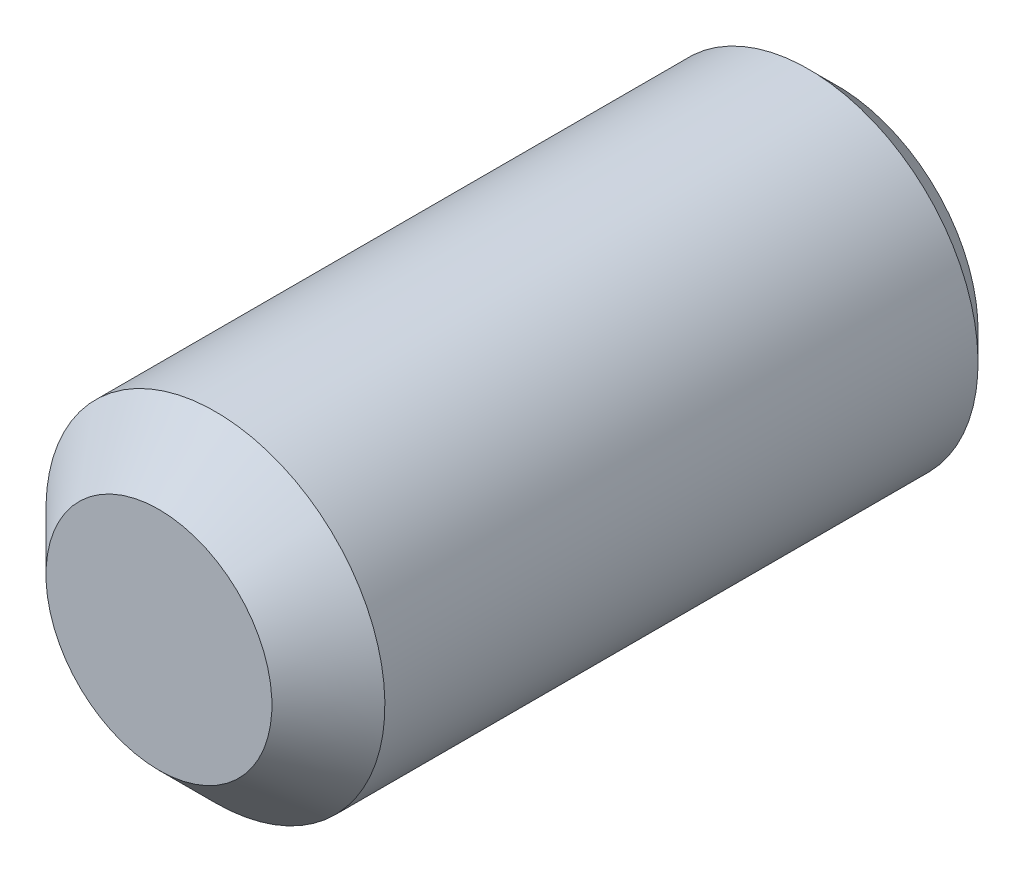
ISO-10303-21;
HEADER;
FILE_DESCRIPTION(('STEP AP214'),'2;1');
FILE_NAME('part.step','',(''),(''),'','','');
FILE_SCHEMA(('AUTOMOTIVE_DESIGN { 1 0 10303 214 1 1 1 1 }'));
ENDSEC;
DATA;
#1=APPLICATION_CONTEXT('core data for automotive mechanical design processes');
#2=APPLICATION_PROTOCOL_DEFINITION('international standard','automotive_design',2000,#1);
#3=PRODUCT_CONTEXT('',#1,'mechanical');
#4=PRODUCT('Part','Part','',(#3));
#5=PRODUCT_RELATED_PRODUCT_CATEGORY('part','',(#4));
#6=PRODUCT_DEFINITION_FORMATION('','',#4);
#7=PRODUCT_DEFINITION_CONTEXT('part definition',#1,'design');
#8=PRODUCT_DEFINITION('design','',#6,#7);
#9=PRODUCT_DEFINITION_SHAPE('','',#8);
#10=(LENGTH_UNIT() NAMED_UNIT(*) SI_UNIT(.MILLI.,.METRE.));
#11=(NAMED_UNIT(*) PLANE_ANGLE_UNIT() SI_UNIT($,.RADIAN.));
#12=(NAMED_UNIT(*) SI_UNIT($,.STERADIAN.) SOLID_ANGLE_UNIT());
#13=UNCERTAINTY_MEASURE_WITH_UNIT(LENGTH_MEASURE(1.E-05),#10,'distance_accuracy_value','');
#14=(GEOMETRIC_REPRESENTATION_CONTEXT(3) GLOBAL_UNCERTAINTY_ASSIGNED_CONTEXT((#13)) GLOBAL_UNIT_ASSIGNED_CONTEXT((#10,
#11,#12)) REPRESENTATION_CONTEXT('',''));
#15=CARTESIAN_POINT('',(0.,0.,0.));
#16=DIRECTION('',(0.,0.,1.));
#17=DIRECTION('',(1.,0.,0.));
#18=AXIS2_PLACEMENT_3D('',#15,#16,#17);
#19=CARTESIAN_POINT('',(0.,2.,12.));
#20=DIRECTION('',(0.,0.,-1.));
#21=DIRECTION('',(0.,1.,0.));
#22=AXIS2_PLACEMENT_3D('',#19,#20,#21);
#23=PLANE('',#22);
#24=CARTESIAN_POINT('',(0.,0.,12.));
#25=DIRECTION('',(0.,0.,1.));
#26=DIRECTION('',(0.,-1.,0.));
#27=AXIS2_PLACEMENT_3D('',#24,#25,#26);
#28=CIRCLE('',#27,2.);
#29=CARTESIAN_POINT('',(0.,-2.,12.));
#30=VERTEX_POINT('',#29);
#31=EDGE_CURVE('E149',#30,#30,#28,.T.);
#32=ORIENTED_EDGE('',*,*,#31,.T.);
#33=EDGE_LOOP('',(#32));
#34=FACE_BOUND('',#33,.T.);
#35=ADVANCED_FACE('F36',(#34),#23,.F.);
#36=CARTESIAN_POINT('',(0.,1.5,0.));
#37=DIRECTION('',(0.,0.,1.));
#38=DIRECTION('',(0.,-1.,0.));
#39=AXIS2_PLACEMENT_3D('',#36,#37,#38);
#40=PLANE('',#39);
#41=CARTESIAN_POINT('',(0.,0.,0.));
#42=DIRECTION('',(0.,0.,1.));
#43=DIRECTION('',(0.,-1.,0.));
#44=AXIS2_PLACEMENT_3D('',#41,#42,#43);
#45=CIRCLE('',#44,2.49);
#46=CARTESIAN_POINT('',(0.,-2.49,0.));
#47=VERTEX_POINT('',#46);
#48=EDGE_CURVE('E178',#47,#47,#45,.T.);
#49=ORIENTED_EDGE('',*,*,#48,.F.);
#50=EDGE_LOOP('',(#49));
#51=FACE_BOUND('',#50,.T.);
#52=DIRECTION('',(0.499999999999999,-0.866025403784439,0.));
#53=VECTOR('',#52,1.);
#54=CARTESIAN_POINT('',(-1.94855715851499,0.375000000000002,0.));
#55=LINE('',#54,#53);
#56=CARTESIAN_POINT('',(-1.73205080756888,0.,0.));
#57=VERTEX_POINT('',#56);
#58=CARTESIAN_POINT('',(-0.86602540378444,-1.5,0.));
#59=VERTEX_POINT('',#58);
#60=EDGE_CURVE('E57',#57,#59,#55,.T.);
#61=ORIENTED_EDGE('',*,*,#60,.T.);
#62=DIRECTION('',(1.,0.,0.));
#63=VECTOR('',#62,1.);
#64=CARTESIAN_POINT('',(0.,-1.5,0.));
#65=LINE('',#64,#63);
#66=CARTESIAN_POINT('',(0.866025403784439,-1.5,0.));
#67=VERTEX_POINT('',#66);
#68=EDGE_CURVE('E11',#59,#67,#65,.T.);
#69=ORIENTED_EDGE('',*,*,#68,.T.);
#70=DIRECTION('',(0.499999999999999,0.866025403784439,0.));
#71=VECTOR('',#70,1.);
#72=CARTESIAN_POINT('',(1.94855715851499,0.375000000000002,0.));
#73=LINE('',#72,#71);
#74=CARTESIAN_POINT('',(1.73205080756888,0.,0.));
#75=VERTEX_POINT('',#74);
#76=EDGE_CURVE('E43',#67,#75,#73,.T.);
#77=ORIENTED_EDGE('',*,*,#76,.T.);
#78=DIRECTION('',(-0.5,0.866025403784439,0.));
#79=VECTOR('',#78,1.);
#80=CARTESIAN_POINT('',(0.649519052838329,1.875,0.));
#81=LINE('',#80,#79);
#82=CARTESIAN_POINT('',(0.866025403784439,1.5,0.));
#83=VERTEX_POINT('',#82);
#84=EDGE_CURVE('E189',#75,#83,#81,.T.);
#85=ORIENTED_EDGE('',*,*,#84,.T.);
#86=DIRECTION('',(-1.,0.,0.));
#87=VECTOR('',#86,1.);
#88=CARTESIAN_POINT('',(0.,1.5,0.));
#89=LINE('',#88,#87);
#90=CARTESIAN_POINT('',(-0.866025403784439,1.5,0.));
#91=VERTEX_POINT('',#90);
#92=EDGE_CURVE('E187',#83,#91,#89,.T.);
#93=ORIENTED_EDGE('',*,*,#92,.T.);
#94=DIRECTION('',(-0.5,-0.866025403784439,0.));
#95=VECTOR('',#94,1.);
#96=CARTESIAN_POINT('',(-0.649519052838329,1.875,0.));
#97=LINE('',#96,#95);
#98=EDGE_CURVE('E185',#91,#57,#97,.T.);
#99=ORIENTED_EDGE('',*,*,#98,.T.);
#100=EDGE_LOOP('',(#61,#69,#77,#85,#93,#99));
#101=FACE_BOUND('',#100,.T.);
#102=ADVANCED_FACE('F192',(#51,#101),#40,.F.);
#103=CARTESIAN_POINT('',(0.,0.,4.40129092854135));
#104=DIRECTION('',(0.,0.,1.));
#105=DIRECTION('',(0.,-1.,0.));
#106=AXIS2_PLACEMENT_3D('',#103,#104,#105);
#107=CYLINDRICAL_SURFACE('',#106,2.49);
#108=CARTESIAN_POINT('',(0.,0.,11.4958578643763));
#109=DIRECTION('',(0.,0.,1.));
#110=DIRECTION('',(0.,-1.,0.));
#111=AXIS2_PLACEMENT_3D('',#108,#109,#110);
#112=CIRCLE('',#111,2.49);
#113=CARTESIAN_POINT('',(0.,-2.49,11.4958578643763));
#114=VERTEX_POINT('',#113);
#115=EDGE_CURVE('E175',#114,#114,#112,.T.);
#116=ORIENTED_EDGE('',*,*,#115,.F.);
#117=EDGE_LOOP('',(#116));
#118=FACE_BOUND('',#117,.T.);
#119=ORIENTED_EDGE('',*,*,#48,.T.);
#120=EDGE_LOOP('',(#119));
#121=FACE_BOUND('',#120,.T.);
#122=ADVANCED_FACE('F248',(#118,#121),#107,.T.);
#123=CARTESIAN_POINT('',(0.,0.,11.4958578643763));
#124=DIRECTION('',(0.,0.,-1.));
#125=DIRECTION('',(0.,1.,0.));
#126=AXIS2_PLACEMENT_3D('',#123,#124,#125);
#127=CONICAL_SURFACE('',#126,2.49,0.785398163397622);
#128=CARTESIAN_POINT('',(0.,0.,11.4858578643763));
#129=DIRECTION('',(0.,0.,1.));
#130=DIRECTION('',(0.,-1.,0.));
#131=AXIS2_PLACEMENT_3D('',#128,#129,#130);
#132=CIRCLE('',#131,2.5);
#133=CARTESIAN_POINT('',(0.,-2.5,11.4858578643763));
#134=VERTEX_POINT('',#133);
#135=EDGE_CURVE('E172',#134,#134,#132,.T.);
#136=ORIENTED_EDGE('',*,*,#135,.F.);
#137=EDGE_LOOP('',(#136));
#138=FACE_BOUND('',#137,.T.);
#139=ORIENTED_EDGE('',*,*,#115,.T.);
#140=EDGE_LOOP('',(#139));
#141=FACE_BOUND('',#140,.T.);
#142=ADVANCED_FACE('F273',(#138,#141),#127,.F.);
#143=CARTESIAN_POINT('',(0.,0.,4.40129092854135));
#144=DIRECTION('',(0.,0.,1.));
#145=DIRECTION('',(0.,-1.,0.));
#146=AXIS2_PLACEMENT_3D('',#143,#144,#145);
#147=CYLINDRICAL_SURFACE('',#146,2.5);
#148=CARTESIAN_POINT('',(0.,0.,0.));
#149=DIRECTION('',(0.,0.,1.));
#150=DIRECTION('',(0.,-1.,0.));
#151=AXIS2_PLACEMENT_3D('',#148,#149,#150);
#152=CIRCLE('',#151,2.5);
#153=CARTESIAN_POINT('',(0.,-2.5,0.));
#154=VERTEX_POINT('',#153);
#155=EDGE_CURVE('E169',#154,#154,#152,.T.);
#156=ORIENTED_EDGE('',*,*,#155,.F.);
#157=EDGE_LOOP('',(#156));
#158=FACE_BOUND('',#157,.T.);
#159=ORIENTED_EDGE('',*,*,#135,.T.);
#160=EDGE_LOOP('',(#159));
#161=FACE_BOUND('',#160,.T.);
#162=ADVANCED_FACE('F267',(#158,#161),#147,.F.);
#163=CARTESIAN_POINT('',(0.,0.,0.));
#164=DIRECTION('',(0.,0.,1.));
#165=DIRECTION('',(0.,-1.,0.));
#166=AXIS2_PLACEMENT_3D('',#163,#164,#165);
#167=CONICAL_SURFACE('',#166,2.5,0.785398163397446);
#168=CARTESIAN_POINT('',(0.,0.,0.5));
#169=DIRECTION('',(0.,0.,1.));
#170=DIRECTION('',(0.,-1.,0.));
#171=AXIS2_PLACEMENT_3D('',#168,#169,#170);
#172=CIRCLE('',#171,3.);
#173=CARTESIAN_POINT('',(0.,-3.,0.5));
#174=VERTEX_POINT('',#173);
#175=EDGE_CURVE('E166',#174,#174,#172,.T.);
#176=ORIENTED_EDGE('',*,*,#175,.F.);
#177=EDGE_LOOP('',(#176));
#178=FACE_BOUND('',#177,.T.);
#179=ORIENTED_EDGE('',*,*,#155,.T.);
#180=EDGE_LOOP('',(#179));
#181=FACE_BOUND('',#180,.T.);
#182=ADVANCED_FACE('F261',(#178,#181),#167,.T.);
#183=CARTESIAN_POINT('',(0.,0.,4.40129092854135));
#184=DIRECTION('',(0.,0.,1.));
#185=DIRECTION('',(0.,-1.,0.));
#186=AXIS2_PLACEMENT_3D('',#183,#184,#185);
#187=CYLINDRICAL_SURFACE('',#186,3.);
#188=CARTESIAN_POINT('',(0.,0.,11.));
#189=DIRECTION('',(0.,0.,1.));
#190=DIRECTION('',(0.,-1.,0.));
#191=AXIS2_PLACEMENT_3D('',#188,#189,#190);
#192=CIRCLE('',#191,3.);
#193=CARTESIAN_POINT('',(0.,-3.,11.));
#194=VERTEX_POINT('',#193);
#195=EDGE_CURVE('E163',#194,#194,#192,.T.);
#196=ORIENTED_EDGE('',*,*,#195,.F.);
#197=EDGE_LOOP('',(#196));
#198=FACE_BOUND('',#197,.T.);
#199=ORIENTED_EDGE('',*,*,#175,.T.);
#200=EDGE_LOOP('',(#199));
#201=FACE_BOUND('',#200,.T.);
#202=ADVANCED_FACE('F255',(#198,#201),#187,.T.);
#203=CARTESIAN_POINT('',(0.,0.,11.));
#204=DIRECTION('',(0.,0.,-1.));
#205=DIRECTION('',(0.,1.,0.));
#206=AXIS2_PLACEMENT_3D('',#203,#204,#205);
#207=CONICAL_SURFACE('',#206,3.,0.785398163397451);
#208=ORIENTED_EDGE('',*,*,#31,.F.);
#209=EDGE_LOOP('',(#208));
#210=FACE_BOUND('',#209,.T.);
#211=ORIENTED_EDGE('',*,*,#195,.T.);
#212=EDGE_LOOP('',(#211));
#213=FACE_BOUND('',#212,.T.);
#214=ADVANCED_FACE('F242',(#210,#213),#207,.T.);
#215=CARTESIAN_POINT('',(0.,0.,3.5));
#216=DIRECTION('',(0.,0.,-1.));
#217=DIRECTION('',(0.,1.,0.));
#218=AXIS2_PLACEMENT_3D('',#215,#216,#217);
#219=PLANE('',#218);
#220=CARTESIAN_POINT('',(0.,0.,3.5));
#221=DIRECTION('',(0.,0.,1.));
#222=DIRECTION('',(0.,-1.,0.));
#223=AXIS2_PLACEMENT_3D('',#220,#221,#222);
#224=CIRCLE('',#223,1.5);
#225=CARTESIAN_POINT('',(0.,1.5,3.5));
#226=VERTEX_POINT('',#225);
#227=CARTESIAN_POINT('',(-1.29903810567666,0.75,3.5));
#228=VERTEX_POINT('',#227);
#229=EDGE_CURVE('E214',#226,#228,#224,.T.);
#230=ORIENTED_EDGE('',*,*,#229,.T.);
#231=DIRECTION('',(0.5,0.866025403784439,0.));
#232=VECTOR('',#231,1.);
#233=CARTESIAN_POINT('',(-1.73205080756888,0.,3.5));
#234=LINE('',#233,#232);
#235=CARTESIAN_POINT('',(-0.866025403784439,1.5,3.5));
#236=VERTEX_POINT('',#235);
#237=EDGE_CURVE('E132',#228,#236,#234,.T.);
#238=ORIENTED_EDGE('',*,*,#237,.T.);
#239=DIRECTION('',(1.,0.,0.));
#240=VECTOR('',#239,1.);
#241=CARTESIAN_POINT('',(-0.866025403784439,1.5,3.5));
#242=LINE('',#241,#240);
#243=EDGE_CURVE('E139',#236,#226,#242,.T.);
#244=ORIENTED_EDGE('',*,*,#243,.T.);
#245=EDGE_LOOP('',(#230,#238,#244));
#246=FACE_BOUND('',#245,.T.);
#247=ADVANCED_FACE('F228',(#246),#219,.T.);
#248=CARTESIAN_POINT('',(-1.29903810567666,-0.749999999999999,3.5));
#249=VERTEX_POINT('',#248);
#250=EDGE_CURVE('E216',#228,#249,#224,.T.);
#251=ORIENTED_EDGE('',*,*,#250,.T.);
#252=DIRECTION('',(-0.499999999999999,0.866025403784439,0.));
#253=VECTOR('',#252,1.);
#254=CARTESIAN_POINT('',(-0.866025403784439,-1.5,3.5));
#255=LINE('',#254,#253);
#256=CARTESIAN_POINT('',(-1.73205080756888,0.,3.5));
#257=VERTEX_POINT('',#256);
#258=EDGE_CURVE('E131',#249,#257,#255,.T.);
#259=ORIENTED_EDGE('',*,*,#258,.T.);
#260=EDGE_CURVE('E134',#257,#228,#234,.T.);
#261=ORIENTED_EDGE('',*,*,#260,.T.);
#262=EDGE_LOOP('',(#251,#259,#261));
#263=FACE_BOUND('',#262,.T.);
#264=ADVANCED_FACE('F221',(#263),#219,.T.);
#265=CARTESIAN_POINT('',(0.,-1.5,3.5));
#266=VERTEX_POINT('',#265);
#267=EDGE_CURVE('E114',#249,#266,#224,.T.);
#268=ORIENTED_EDGE('',*,*,#267,.T.);
#269=DIRECTION('',(-1.,0.,0.));
#270=VECTOR('',#269,1.);
#271=CARTESIAN_POINT('',(0.866025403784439,-1.5,3.5));
#272=LINE('',#271,#270);
#273=CARTESIAN_POINT('',(-0.866025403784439,-1.5,3.5));
#274=VERTEX_POINT('',#273);
#275=EDGE_CURVE('E108',#266,#274,#272,.T.);
#276=ORIENTED_EDGE('',*,*,#275,.T.);
#277=EDGE_CURVE('E112',#274,#249,#255,.T.);
#278=ORIENTED_EDGE('',*,*,#277,.T.);
#279=EDGE_LOOP('',(#268,#276,#278));
#280=FACE_BOUND('',#279,.T.);
#281=ADVANCED_FACE('F110',(#280),#219,.T.);
#282=CARTESIAN_POINT('',(1.29903810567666,-0.749999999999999,3.5));
#283=VERTEX_POINT('',#282);
#284=EDGE_CURVE('E181',#266,#283,#224,.T.);
#285=ORIENTED_EDGE('',*,*,#284,.T.);
#286=DIRECTION('',(-0.499999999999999,-0.866025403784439,0.));
#287=VECTOR('',#286,1.);
#288=CARTESIAN_POINT('',(1.73205080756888,0.,3.5));
#289=LINE('',#288,#287);
#290=CARTESIAN_POINT('',(0.866025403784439,-1.5,3.5));
#291=VERTEX_POINT('',#290);
#292=EDGE_CURVE('E144',#283,#291,#289,.T.);
#293=ORIENTED_EDGE('',*,*,#292,.T.);
#294=EDGE_CURVE('E118',#291,#266,#272,.T.);
#295=ORIENTED_EDGE('',*,*,#294,.T.);
#296=EDGE_LOOP('',(#285,#293,#295));
#297=FACE_BOUND('',#296,.T.);
#298=ADVANCED_FACE('F239',(#297),#219,.T.);
#299=CARTESIAN_POINT('',(1.29903810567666,0.750000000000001,3.5));
#300=VERTEX_POINT('',#299);
#301=EDGE_CURVE('E183',#283,#300,#224,.T.);
#302=ORIENTED_EDGE('',*,*,#301,.T.);
#303=DIRECTION('',(0.5,-0.866025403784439,0.));
#304=VECTOR('',#303,1.);
#305=CARTESIAN_POINT('',(0.866025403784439,1.5,3.5));
#306=LINE('',#305,#304);
#307=CARTESIAN_POINT('',(1.73205080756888,0.,3.5));
#308=VERTEX_POINT('',#307);
#309=EDGE_CURVE('E142',#300,#308,#306,.T.);
#310=ORIENTED_EDGE('',*,*,#309,.T.);
#311=EDGE_CURVE('E126',#308,#283,#289,.T.);
#312=ORIENTED_EDGE('',*,*,#311,.T.);
#313=EDGE_LOOP('',(#302,#310,#312));
#314=FACE_BOUND('',#313,.T.);
#315=ADVANCED_FACE('F206',(#314),#219,.T.);
#316=EDGE_CURVE('E213',#300,#226,#224,.T.);
#317=ORIENTED_EDGE('',*,*,#316,.T.);
#318=CARTESIAN_POINT('',(0.866025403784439,1.5,3.5));
#319=VERTEX_POINT('',#318);
#320=EDGE_CURVE('E138',#226,#319,#242,.T.);
#321=ORIENTED_EDGE('',*,*,#320,.T.);
#322=EDGE_CURVE('E50',#319,#300,#306,.T.);
#323=ORIENTED_EDGE('',*,*,#322,.T.);
#324=EDGE_LOOP('',(#317,#321,#323));
#325=FACE_BOUND('',#324,.T.);
#326=ADVANCED_FACE('F231',(#325),#219,.T.);
#327=CARTESIAN_POINT('',(0.866025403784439,-1.5,3.5));
#328=DIRECTION('',(0.,-1.,0.));
#329=DIRECTION('',(0.,0.,-1.));
#330=AXIS2_PLACEMENT_3D('',#327,#328,#329);
#331=PLANE('',#330);
#332=ORIENTED_EDGE('',*,*,#294,.F.);
#333=DIRECTION('',(0.,0.,-1.));
#334=VECTOR('',#333,1.);
#335=CARTESIAN_POINT('',(0.866025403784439,-1.5,3.5));
#336=LINE('',#335,#334);
#337=EDGE_CURVE('E147',#291,#67,#336,.T.);
#338=ORIENTED_EDGE('',*,*,#337,.T.);
#339=ORIENTED_EDGE('',*,*,#68,.F.);
#340=DIRECTION('',(0.,0.,-1.));
#341=VECTOR('',#340,1.);
#342=CARTESIAN_POINT('',(-0.866025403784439,-1.5,3.5));
#343=LINE('',#342,#341);
#344=EDGE_CURVE('E121',#274,#59,#343,.T.);
#345=ORIENTED_EDGE('',*,*,#344,.F.);
#346=ORIENTED_EDGE('',*,*,#275,.F.);
#347=EDGE_LOOP('',(#332,#338,#339,#345,#346));
#348=FACE_BOUND('',#347,.T.);
#349=ADVANCED_FACE('F122',(#348),#331,.F.);
#350=CARTESIAN_POINT('',(1.73205080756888,0.,3.5));
#351=DIRECTION('',(0.866025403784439,-0.499999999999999,0.));
#352=DIRECTION('',(0.499999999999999,0.866025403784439,0.));
#353=AXIS2_PLACEMENT_3D('',#350,#351,#352);
#354=PLANE('',#353);
#355=ORIENTED_EDGE('',*,*,#311,.F.);
#356=DIRECTION('',(0.,0.,-1.));
#357=VECTOR('',#356,1.);
#358=CARTESIAN_POINT('',(1.73205080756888,0.,3.5));
#359=LINE('',#358,#357);
#360=EDGE_CURVE('E150',#308,#75,#359,.T.);
#361=ORIENTED_EDGE('',*,*,#360,.T.);
#362=ORIENTED_EDGE('',*,*,#76,.F.);
#363=ORIENTED_EDGE('',*,*,#337,.F.);
#364=ORIENTED_EDGE('',*,*,#292,.F.);
#365=EDGE_LOOP('',(#355,#361,#362,#363,#364));
#366=FACE_BOUND('',#365,.T.);
#367=ADVANCED_FACE('F201',(#366),#354,.F.);
#368=CARTESIAN_POINT('',(0.866025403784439,1.5,3.5));
#369=DIRECTION('',(0.866025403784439,0.5,0.));
#370=DIRECTION('',(-0.5,0.866025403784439,0.));
#371=AXIS2_PLACEMENT_3D('',#368,#369,#370);
#372=PLANE('',#371);
#373=ORIENTED_EDGE('',*,*,#322,.F.);
#374=DIRECTION('',(0.,0.,-1.));
#375=VECTOR('',#374,1.);
#376=CARTESIAN_POINT('',(0.866025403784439,1.5,3.5));
#377=LINE('',#376,#375);
#378=EDGE_CURVE('E153',#319,#83,#377,.T.);
#379=ORIENTED_EDGE('',*,*,#378,.T.);
#380=ORIENTED_EDGE('',*,*,#84,.F.);
#381=ORIENTED_EDGE('',*,*,#360,.F.);
#382=ORIENTED_EDGE('',*,*,#309,.F.);
#383=EDGE_LOOP('',(#373,#379,#380,#381,#382));
#384=FACE_BOUND('',#383,.T.);
#385=ADVANCED_FACE('F198',(#384),#372,.F.);
#386=CARTESIAN_POINT('',(-0.866025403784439,1.5,3.5));
#387=DIRECTION('',(0.,1.,0.));
#388=DIRECTION('',(0.,0.,1.));
#389=AXIS2_PLACEMENT_3D('',#386,#387,#388);
#390=PLANE('',#389);
#391=ORIENTED_EDGE('',*,*,#243,.F.);
#392=DIRECTION('',(0.,0.,-1.));
#393=VECTOR('',#392,1.);
#394=CARTESIAN_POINT('',(-0.866025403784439,1.5,3.5));
#395=LINE('',#394,#393);
#396=EDGE_CURVE('E156',#236,#91,#395,.T.);
#397=ORIENTED_EDGE('',*,*,#396,.T.);
#398=ORIENTED_EDGE('',*,*,#92,.F.);
#399=ORIENTED_EDGE('',*,*,#378,.F.);
#400=ORIENTED_EDGE('',*,*,#320,.F.);
#401=EDGE_LOOP('',(#391,#397,#398,#399,#400));
#402=FACE_BOUND('',#401,.T.);
#403=ADVANCED_FACE('F230',(#402),#390,.F.);
#404=CARTESIAN_POINT('',(-1.73205080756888,0.,3.5));
#405=DIRECTION('',(-0.866025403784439,0.5,0.));
#406=DIRECTION('',(-0.5,-0.866025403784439,0.));
#407=AXIS2_PLACEMENT_3D('',#404,#405,#406);
#408=PLANE('',#407);
#409=ORIENTED_EDGE('',*,*,#260,.F.);
#410=DIRECTION('',(0.,0.,-1.));
#411=VECTOR('',#410,1.);
#412=CARTESIAN_POINT('',(-1.73205080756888,0.,3.5));
#413=LINE('',#412,#411);
#414=EDGE_CURVE('E125',#257,#57,#413,.T.);
#415=ORIENTED_EDGE('',*,*,#414,.T.);
#416=ORIENTED_EDGE('',*,*,#98,.F.);
#417=ORIENTED_EDGE('',*,*,#396,.F.);
#418=ORIENTED_EDGE('',*,*,#237,.F.);
#419=EDGE_LOOP('',(#409,#415,#416,#417,#418));
#420=FACE_BOUND('',#419,.T.);
#421=ADVANCED_FACE('F224',(#420),#408,.F.);
#422=CARTESIAN_POINT('',(-0.866025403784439,-1.5,3.5));
#423=DIRECTION('',(-0.866025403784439,-0.499999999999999,0.));
#424=DIRECTION('',(0.499999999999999,-0.866025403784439,0.));
#425=AXIS2_PLACEMENT_3D('',#422,#423,#424);
#426=PLANE('',#425);
#427=ORIENTED_EDGE('',*,*,#277,.F.);
#428=ORIENTED_EDGE('',*,*,#344,.T.);
#429=ORIENTED_EDGE('',*,*,#60,.F.);
#430=ORIENTED_EDGE('',*,*,#414,.F.);
#431=ORIENTED_EDGE('',*,*,#258,.F.);
#432=EDGE_LOOP('',(#427,#428,#429,#430,#431));
#433=FACE_BOUND('',#432,.T.);
#434=ADVANCED_FACE('F129',(#433),#426,.F.);
#435=CARTESIAN_POINT('',(0.,0.,4.40129092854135));
#436=DIRECTION('',(0.,0.,-1.));
#437=DIRECTION('',(0.,1.,0.));
#438=AXIS2_PLACEMENT_3D('',#435,#436,#437);
#439=CONICAL_SURFACE('',#438,0.,1.02974425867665);
#440=ORIENTED_EDGE('',*,*,#284,.F.);
#441=ORIENTED_EDGE('',*,*,#267,.F.);
#442=ORIENTED_EDGE('',*,*,#250,.F.);
#443=ORIENTED_EDGE('',*,*,#229,.F.);
#444=ORIENTED_EDGE('',*,*,#316,.F.);
#445=ORIENTED_EDGE('',*,*,#301,.F.);
#446=EDGE_LOOP('',(#440,#441,#442,#443,#444,#445));
#447=FACE_BOUND('',#446,.T.);
#448=CARTESIAN_POINT('',(0.,0.,4.40129092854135));
#449=VERTEX_POINT('',#448);
#450=VERTEX_LOOP('',#449);
#451=FACE_BOUND('',#450,.T.);
#452=ADVANCED_FACE('F210',(#447,#451),#439,.F.);
#453=CLOSED_SHELL('',(#35,#102,#122,#142,#162,#182,#202,#214,#247,#264,#281,#298,#315,#326,#349,
#367,#385,#403,#421,#434,#452));
#454=MANIFOLD_SOLID_BREP('B2',#453);
#455=ADVANCED_BREP_SHAPE_REPRESENTATION('',(#18,#454),#14);
#456=SHAPE_DEFINITION_REPRESENTATION(#9,#455);
ENDSEC;
END-ISO-10303-21;
